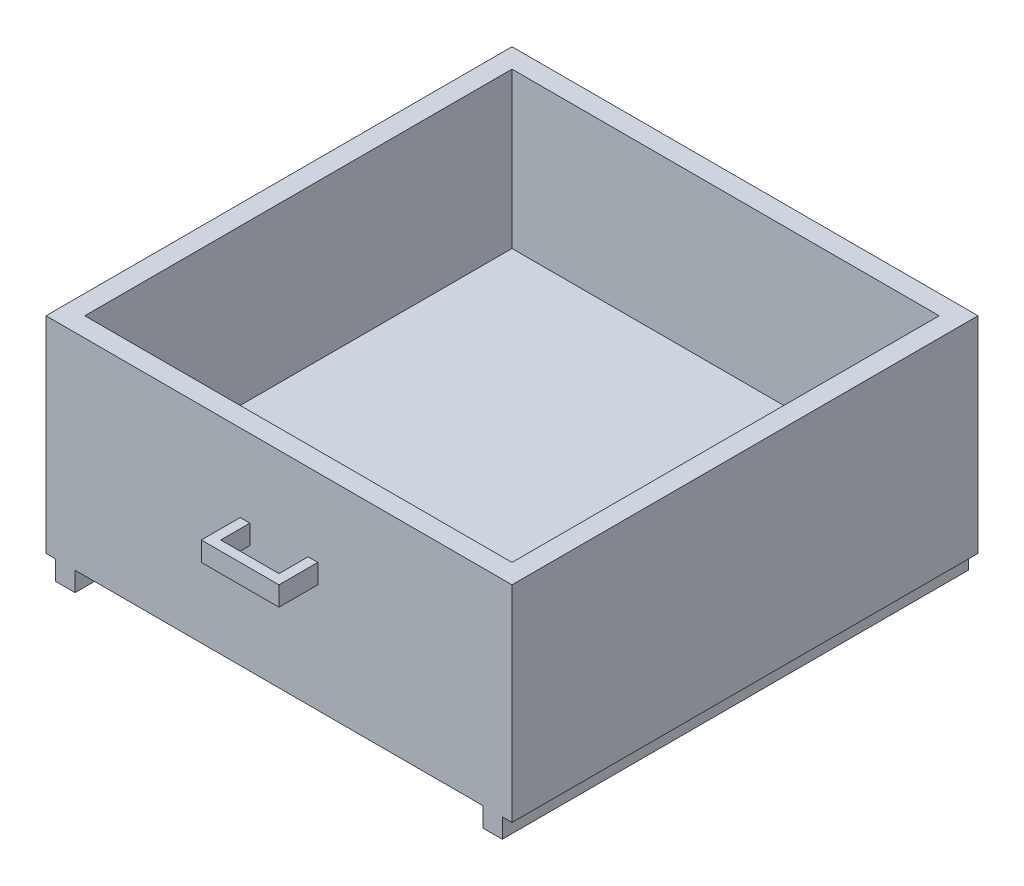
from build123d import *

# Parameters (mm, degrees)
BOSS_EXTRUDE1_DEPTH = 152.4
SKETCH2_W           = 279.4
SKETCH2_H           = 279.4
CUT_EXTRUDE1_DEPTH  = 101.6
SKETCH3_W           = 50.8
SKETCH3_H           = 12.7
BOSS_EXTRUDE2_DEPTH = 25.4
SKETCH4_W           = 38.1
SKETCH4_H           = 19.05
CUT_EXTRUDE2_DEPTH  = 254.287801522


with BuildPart() as part:
    # Sketch1 → Boss-Extrude1 (new, symmetric)
    with BuildSketch(Plane.XY):
        Polygon((-152.4, 134.62), (152.4, 134.62), (152.4, 0), (146.05, 0), (146.05, -12.7), (133.35, -12.7), (133.35, 0), (-133.35, 0), (-133.35, -12.7), (-146.05, -12.7), (-146.05, 0), (-152.4, 0), align=None)
    extrude(amount=BOSS_EXTRUDE1_DEPTH, both=True)

    # Sketch2 → Cut-Extrude1 (cut)
    with BuildSketch(Plane(origin=(0, 134.62, 0), x_dir=(1, 0, 0), z_dir=(0, 1, 0))):
        Rectangle(SKETCH2_W, SKETCH2_H)
    extrude(amount=-CUT_EXTRUDE1_DEPTH, mode=Mode.SUBTRACT)

    # Sketch3 → Boss-Extrude2 (add)
    with BuildSketch(Plane.XY.offset(152.4)):
        with Locations((0, 77.47)):
            Rectangle(SKETCH3_W, SKETCH3_H)
    extrude(amount=BOSS_EXTRUDE2_DEPTH)

    # Sketch4 → Cut-Extrude2 (cut, through all)
    with BuildSketch(Plane(origin=(0, 83.82, 0), x_dir=(1, 0, 0), z_dir=(0, 1, 0))):
        with Locations((0, -161.925)):
            Rectangle(SKETCH4_W, SKETCH4_H)
    extrude(amount=-CUT_EXTRUDE2_DEPTH, mode=Mode.SUBTRACT)


solid = part.part
